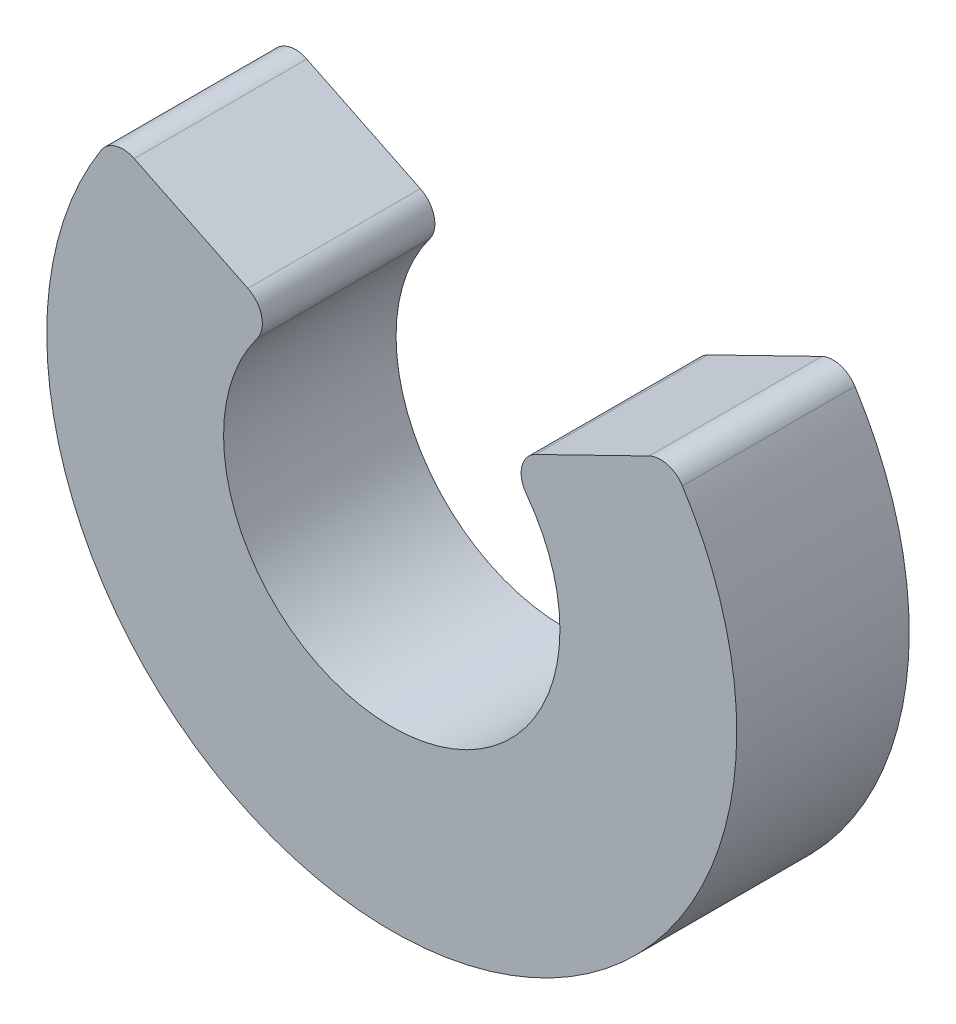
from build123d import *

# Parameters (mm, degrees)
BOSS_EXTRU_1_DEPTH = 2


with BuildPart() as part:
    # Esquisse1 → Boss.-Extru.1 (new body)
    with BuildSketch(Plane.XY):
        with BuildLine():
            Line((-2.985668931, 2.262707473), (-1.668383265, 1.619586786))
            ThreePointArc((-1.668383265, 1.619586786), (-1.508354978, 1.42030776), (-1.56, 1.17))
            ThreePointArc((-1.56, 1.17), (0, -1.95), (1.56, 1.17))
            ThreePointArc((1.56, 1.17), (1.508354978, 1.42030776), (1.668383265, 1.619586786))
            Line((1.668383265, 1.619586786), (2.985668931, 2.262707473))
            ThreePointArc((2.985668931, 2.262707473), (3.198424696, 2.281939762), (3.370038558, 2.154725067))
            ThreePointArc((3.370038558, 2.154725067), (0, -4), (-3.370038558, 2.154725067))
            ThreePointArc((-3.370038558, 2.154725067), (-3.198424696, 2.281939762), (-2.985668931, 2.262707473))
        make_face()
    extrude(amount=BOSS_EXTRU_1_DEPTH)


solid = part.part
